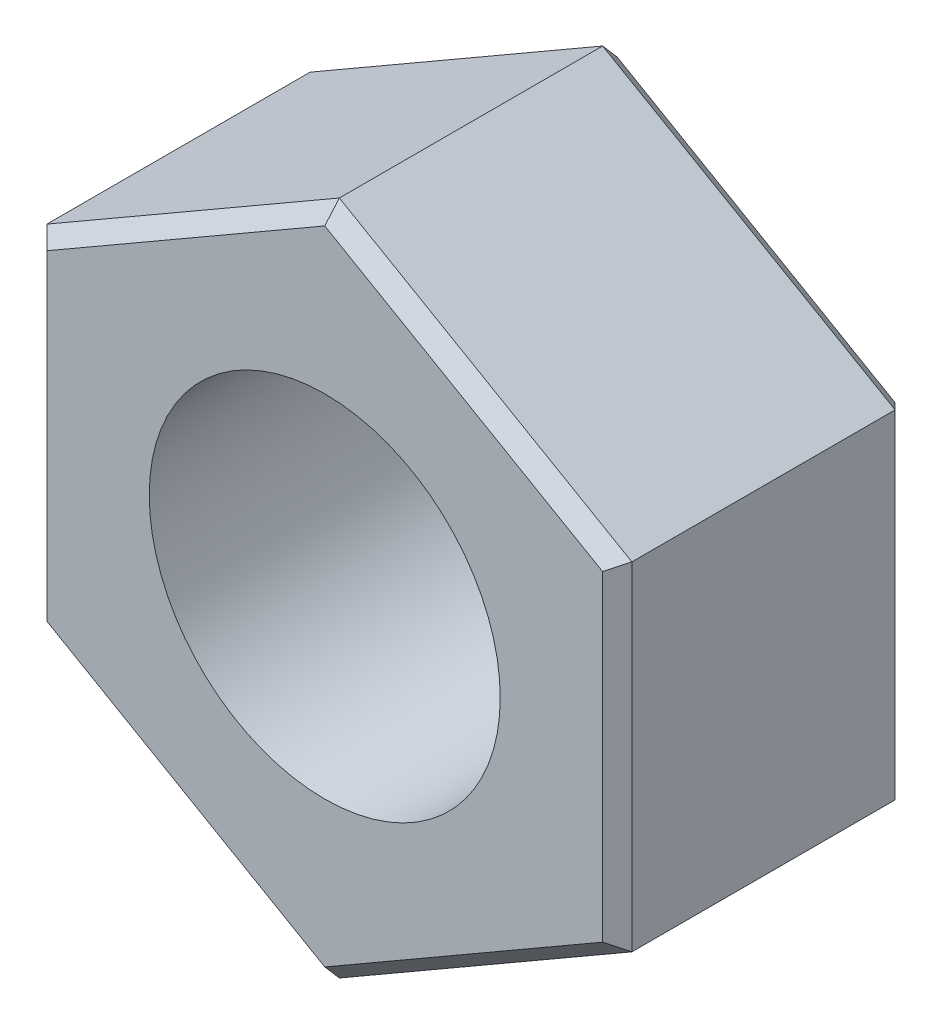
ISO-10303-21;
HEADER;
FILE_DESCRIPTION(('STEP AP214'),'2;1');
FILE_NAME('part.step','',(''),(''),'','','');
FILE_SCHEMA(('AUTOMOTIVE_DESIGN { 1 0 10303 214 1 1 1 1 }'));
ENDSEC;
DATA;
#1=APPLICATION_CONTEXT('core data for automotive mechanical design processes');
#2=APPLICATION_PROTOCOL_DEFINITION('international standard','automotive_design',2000,#1);
#3=PRODUCT_CONTEXT('',#1,'mechanical');
#4=PRODUCT('Part','Part','',(#3));
#5=PRODUCT_RELATED_PRODUCT_CATEGORY('part','',(#4));
#6=PRODUCT_DEFINITION_FORMATION('','',#4);
#7=PRODUCT_DEFINITION_CONTEXT('part definition',#1,'design');
#8=PRODUCT_DEFINITION('design','',#6,#7);
#9=PRODUCT_DEFINITION_SHAPE('','',#8);
#10=(LENGTH_UNIT() NAMED_UNIT(*) SI_UNIT(.MILLI.,.METRE.));
#11=(NAMED_UNIT(*) PLANE_ANGLE_UNIT() SI_UNIT($,.RADIAN.));
#12=(NAMED_UNIT(*) SI_UNIT($,.STERADIAN.) SOLID_ANGLE_UNIT());
#13=UNCERTAINTY_MEASURE_WITH_UNIT(LENGTH_MEASURE(1.E-05),#10,'distance_accuracy_value','');
#14=(GEOMETRIC_REPRESENTATION_CONTEXT(3) GLOBAL_UNCERTAINTY_ASSIGNED_CONTEXT((#13)) GLOBAL_UNIT_ASSIGNED_CONTEXT((#10,
#11,#12)) REPRESENTATION_CONTEXT('',''));
#15=CARTESIAN_POINT('',(0.,0.,0.));
#16=DIRECTION('',(0.,0.,1.));
#17=DIRECTION('',(1.,0.,0.));
#18=AXIS2_PLACEMENT_3D('',#15,#16,#17);
#19=CARTESIAN_POINT('',(5.,2.88675134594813,5.));
#20=DIRECTION('',(-0.5,-0.866025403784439,0.));
#21=DIRECTION('',(0.866025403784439,-0.5,0.));
#22=AXIS2_PLACEMENT_3D('',#19,#20,#21);
#23=PLANE('',#22);
#24=DIRECTION('',(0.,0.,-1.));
#25=VECTOR('',#24,1.);
#26=CARTESIAN_POINT('',(5.,2.88675134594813,5.));
#27=LINE('',#26,#25);
#28=CARTESIAN_POINT('',(5.,2.88675134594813,4.75));
#29=VERTEX_POINT('',#28);
#30=CARTESIAN_POINT('',(5.,2.88675134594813,0.250000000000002));
#31=VERTEX_POINT('',#30);
#32=EDGE_CURVE('E258',#29,#31,#27,.T.);
#33=ORIENTED_EDGE('',*,*,#32,.T.);
#34=DIRECTION('',(-0.866025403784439,0.5,0.));
#35=VECTOR('',#34,1.);
#36=CARTESIAN_POINT('',(5.,2.88675134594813,0.250000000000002));
#37=LINE('',#36,#35);
#38=CARTESIAN_POINT('',(0.,5.77350269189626,0.250000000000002));
#39=VERTEX_POINT('',#38);
#40=EDGE_CURVE('E221',#31,#39,#37,.T.);
#41=ORIENTED_EDGE('',*,*,#40,.T.);
#42=DIRECTION('',(0.,0.,-1.));
#43=VECTOR('',#42,1.);
#44=CARTESIAN_POINT('',(0.,5.77350269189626,5.));
#45=LINE('',#44,#43);
#46=CARTESIAN_POINT('',(0.,5.77350269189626,4.75));
#47=VERTEX_POINT('',#46);
#48=EDGE_CURVE('E157',#47,#39,#45,.T.);
#49=ORIENTED_EDGE('',*,*,#48,.F.);
#50=DIRECTION('',(0.866025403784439,-0.5,0.));
#51=VECTOR('',#50,1.);
#52=CARTESIAN_POINT('',(5.,2.88675134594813,4.75));
#53=LINE('',#52,#51);
#54=EDGE_CURVE('E218',#47,#29,#53,.T.);
#55=ORIENTED_EDGE('',*,*,#54,.T.);
#56=EDGE_LOOP('',(#33,#41,#49,#55));
#57=FACE_BOUND('',#56,.T.);
#58=ADVANCED_FACE('F41',(#57),#23,.F.);
#59=CARTESIAN_POINT('',(0.,5.77350269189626,5.));
#60=DIRECTION('',(0.5,-0.866025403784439,0.));
#61=DIRECTION('',(0.866025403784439,0.5,0.));
#62=AXIS2_PLACEMENT_3D('',#59,#60,#61);
#63=PLANE('',#62);
#64=ORIENTED_EDGE('',*,*,#48,.T.);
#65=DIRECTION('',(-0.866025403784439,-0.5,0.));
#66=VECTOR('',#65,1.);
#67=CARTESIAN_POINT('',(0.,5.77350269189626,0.250000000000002));
#68=LINE('',#67,#66);
#69=CARTESIAN_POINT('',(-5.,2.88675134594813,0.250000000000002));
#70=VERTEX_POINT('',#69);
#71=EDGE_CURVE('E155',#39,#70,#68,.T.);
#72=ORIENTED_EDGE('',*,*,#71,.T.);
#73=DIRECTION('',(0.,0.,-1.));
#74=VECTOR('',#73,1.);
#75=CARTESIAN_POINT('',(-5.,2.88675134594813,5.));
#76=LINE('',#75,#74);
#77=CARTESIAN_POINT('',(-5.,2.88675134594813,4.75));
#78=VERTEX_POINT('',#77);
#79=EDGE_CURVE('E136',#78,#70,#76,.T.);
#80=ORIENTED_EDGE('',*,*,#79,.F.);
#81=DIRECTION('',(0.866025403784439,0.5,0.));
#82=VECTOR('',#81,1.);
#83=CARTESIAN_POINT('',(0.,5.77350269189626,4.75));
#84=LINE('',#83,#82);
#85=EDGE_CURVE('E152',#78,#47,#84,.T.);
#86=ORIENTED_EDGE('',*,*,#85,.T.);
#87=EDGE_LOOP('',(#64,#72,#80,#86));
#88=FACE_BOUND('',#87,.T.);
#89=ADVANCED_FACE('F150',(#88),#63,.F.);
#90=CARTESIAN_POINT('',(-5.,2.88675134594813,5.));
#91=DIRECTION('',(1.,0.,0.));
#92=DIRECTION('',(0.,1.,0.));
#93=AXIS2_PLACEMENT_3D('',#90,#91,#92);
#94=PLANE('',#93);
#95=ORIENTED_EDGE('',*,*,#79,.T.);
#96=DIRECTION('',(0.,-1.,0.));
#97=VECTOR('',#96,1.);
#98=CARTESIAN_POINT('',(-5.,2.88675134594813,0.250000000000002));
#99=LINE('',#98,#97);
#100=CARTESIAN_POINT('',(-5.,-2.88675134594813,0.250000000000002));
#101=VERTEX_POINT('',#100);
#102=EDGE_CURVE('E144',#70,#101,#99,.T.);
#103=ORIENTED_EDGE('',*,*,#102,.T.);
#104=DIRECTION('',(0.,0.,-1.));
#105=VECTOR('',#104,1.);
#106=CARTESIAN_POINT('',(-5.,-2.88675134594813,5.));
#107=LINE('',#106,#105);
#108=CARTESIAN_POINT('',(-5.,-2.88675134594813,4.75));
#109=VERTEX_POINT('',#108);
#110=EDGE_CURVE('E138',#109,#101,#107,.T.);
#111=ORIENTED_EDGE('',*,*,#110,.F.);
#112=DIRECTION('',(0.,1.,0.));
#113=VECTOR('',#112,1.);
#114=CARTESIAN_POINT('',(-5.,2.88675134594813,4.75));
#115=LINE('',#114,#113);
#116=EDGE_CURVE('E133',#109,#78,#115,.T.);
#117=ORIENTED_EDGE('',*,*,#116,.T.);
#118=EDGE_LOOP('',(#95,#103,#111,#117));
#119=FACE_BOUND('',#118,.T.);
#120=ADVANCED_FACE('F135',(#119),#94,.F.);
#121=CARTESIAN_POINT('',(-5.,-2.88675134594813,5.));
#122=DIRECTION('',(0.5,0.866025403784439,0.));
#123=DIRECTION('',(-0.866025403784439,0.5,0.));
#124=AXIS2_PLACEMENT_3D('',#121,#122,#123);
#125=PLANE('',#124);
#126=ORIENTED_EDGE('',*,*,#110,.T.);
#127=DIRECTION('',(0.866025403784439,-0.5,0.));
#128=VECTOR('',#127,1.);
#129=CARTESIAN_POINT('',(-5.,-2.88675134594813,0.250000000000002));
#130=LINE('',#129,#128);
#131=CARTESIAN_POINT('',(0.,-5.77350269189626,0.250000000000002));
#132=VERTEX_POINT('',#131);
#133=EDGE_CURVE('E202',#101,#132,#130,.T.);
#134=ORIENTED_EDGE('',*,*,#133,.T.);
#135=DIRECTION('',(0.,0.,-1.));
#136=VECTOR('',#135,1.);
#137=CARTESIAN_POINT('',(0.,-5.77350269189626,5.));
#138=LINE('',#137,#136);
#139=CARTESIAN_POINT('',(0.,-5.77350269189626,4.75));
#140=VERTEX_POINT('',#139);
#141=EDGE_CURVE('E281',#140,#132,#138,.T.);
#142=ORIENTED_EDGE('',*,*,#141,.F.);
#143=DIRECTION('',(-0.866025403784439,0.5,0.));
#144=VECTOR('',#143,1.);
#145=CARTESIAN_POINT('',(-5.,-2.88675134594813,4.75));
#146=LINE('',#145,#144);
#147=EDGE_CURVE('E199',#140,#109,#146,.T.);
#148=ORIENTED_EDGE('',*,*,#147,.T.);
#149=EDGE_LOOP('',(#126,#134,#142,#148));
#150=FACE_BOUND('',#149,.T.);
#151=ADVANCED_FACE('F278',(#150),#125,.F.);
#152=CARTESIAN_POINT('',(0.,-5.77350269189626,5.));
#153=DIRECTION('',(-0.5,0.866025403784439,0.));
#154=DIRECTION('',(-0.866025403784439,-0.5,0.));
#155=AXIS2_PLACEMENT_3D('',#152,#153,#154);
#156=PLANE('',#155);
#157=ORIENTED_EDGE('',*,*,#141,.T.);
#158=DIRECTION('',(0.866025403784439,0.5,0.));
#159=VECTOR('',#158,1.);
#160=CARTESIAN_POINT('',(0.,-5.77350269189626,0.250000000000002));
#161=LINE('',#160,#159);
#162=CARTESIAN_POINT('',(5.,-2.88675134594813,0.250000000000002));
#163=VERTEX_POINT('',#162);
#164=EDGE_CURVE('E208',#132,#163,#161,.T.);
#165=ORIENTED_EDGE('',*,*,#164,.T.);
#166=DIRECTION('',(0.,0.,-1.));
#167=VECTOR('',#166,1.);
#168=CARTESIAN_POINT('',(5.,-2.88675134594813,5.));
#169=LINE('',#168,#167);
#170=CARTESIAN_POINT('',(5.,-2.88675134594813,4.75));
#171=VERTEX_POINT('',#170);
#172=EDGE_CURVE('E285',#171,#163,#169,.T.);
#173=ORIENTED_EDGE('',*,*,#172,.F.);
#174=DIRECTION('',(-0.866025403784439,-0.5,0.));
#175=VECTOR('',#174,1.);
#176=CARTESIAN_POINT('',(0.,-5.77350269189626,4.75));
#177=LINE('',#176,#175);
#178=EDGE_CURVE('E205',#171,#140,#177,.T.);
#179=ORIENTED_EDGE('',*,*,#178,.T.);
#180=EDGE_LOOP('',(#157,#165,#173,#179));
#181=FACE_BOUND('',#180,.T.);
#182=ADVANCED_FACE('F324',(#181),#156,.F.);
#183=CARTESIAN_POINT('',(5.,-2.88675134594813,5.));
#184=DIRECTION('',(-1.,0.,0.));
#185=DIRECTION('',(0.,-1.,0.));
#186=AXIS2_PLACEMENT_3D('',#183,#184,#185);
#187=PLANE('',#186);
#188=ORIENTED_EDGE('',*,*,#172,.T.);
#189=DIRECTION('',(0.,1.,0.));
#190=VECTOR('',#189,1.);
#191=CARTESIAN_POINT('',(5.,-2.88675134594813,0.250000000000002));
#192=LINE('',#191,#190);
#193=EDGE_CURVE('E215',#163,#31,#192,.T.);
#194=ORIENTED_EDGE('',*,*,#193,.T.);
#195=ORIENTED_EDGE('',*,*,#32,.F.);
#196=DIRECTION('',(0.,-1.,0.));
#197=VECTOR('',#196,1.);
#198=CARTESIAN_POINT('',(5.,-2.88675134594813,4.75));
#199=LINE('',#198,#197);
#200=EDGE_CURVE('E211',#29,#171,#199,.T.);
#201=ORIENTED_EDGE('',*,*,#200,.T.);
#202=EDGE_LOOP('',(#188,#194,#195,#201));
#203=FACE_BOUND('',#202,.T.);
#204=ADVANCED_FACE('F316',(#203),#187,.F.);
#205=CARTESIAN_POINT('',(0.,0.,5.));
#206=DIRECTION('',(0.,0.,1.));
#207=DIRECTION('',(1.,0.,0.));
#208=AXIS2_PLACEMENT_3D('',#205,#206,#207);
#209=PLANE('',#208);
#210=CARTESIAN_POINT('',(0.,0.,5.));
#211=DIRECTION('',(0.,0.,1.));
#212=DIRECTION('',(1.,0.,0.));
#213=AXIS2_PLACEMENT_3D('',#210,#211,#212);
#214=CIRCLE('',#213,3.);
#215=CARTESIAN_POINT('',(3.,0.,5.));
#216=VERTEX_POINT('',#215);
#217=EDGE_CURVE('E296',#216,#216,#214,.T.);
#218=ORIENTED_EDGE('',*,*,#217,.F.);
#219=EDGE_LOOP('',(#218));
#220=FACE_BOUND('',#219,.T.);
#221=DIRECTION('',(0.866025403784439,0.5,0.));
#222=VECTOR('',#221,1.);
#223=CARTESIAN_POINT('',(4.875,-2.67024499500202,5.));
#224=LINE('',#223,#222);
#225=CARTESIAN_POINT('',(0.,-5.48482755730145,5.));
#226=VERTEX_POINT('',#225);
#227=CARTESIAN_POINT('',(4.75,-2.74241377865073,5.));
#228=VERTEX_POINT('',#227);
#229=EDGE_CURVE('E52',#226,#228,#224,.T.);
#230=ORIENTED_EDGE('',*,*,#229,.T.);
#231=DIRECTION('',(0.,1.,0.));
#232=VECTOR('',#231,1.);
#233=CARTESIAN_POINT('',(4.75,2.88675134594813,5.));
#234=LINE('',#233,#232);
#235=CARTESIAN_POINT('',(4.75,2.74241377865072,5.));
#236=VERTEX_POINT('',#235);
#237=EDGE_CURVE('E11',#228,#236,#234,.T.);
#238=ORIENTED_EDGE('',*,*,#237,.T.);
#239=DIRECTION('',(-0.866025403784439,0.5,0.));
#240=VECTOR('',#239,1.);
#241=CARTESIAN_POINT('',(-0.124999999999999,5.55699634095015,5.));
#242=LINE('',#241,#240);
#243=CARTESIAN_POINT('',(0.,5.48482755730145,5.));
#244=VERTEX_POINT('',#243);
#245=EDGE_CURVE('E224',#236,#244,#242,.T.);
#246=ORIENTED_EDGE('',*,*,#245,.T.);
#247=DIRECTION('',(-0.866025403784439,-0.5,0.));
#248=VECTOR('',#247,1.);
#249=CARTESIAN_POINT('',(-4.875,2.67024499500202,5.));
#250=LINE('',#249,#248);
#251=CARTESIAN_POINT('',(-4.75,2.74241377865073,5.));
#252=VERTEX_POINT('',#251);
#253=EDGE_CURVE('E227',#244,#252,#250,.T.);
#254=ORIENTED_EDGE('',*,*,#253,.T.);
#255=DIRECTION('',(0.,-1.,0.));
#256=VECTOR('',#255,1.);
#257=CARTESIAN_POINT('',(-4.75,-2.88675134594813,5.));
#258=LINE('',#257,#256);
#259=CARTESIAN_POINT('',(-4.75,-2.74241377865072,5.));
#260=VERTEX_POINT('',#259);
#261=EDGE_CURVE('E162',#252,#260,#258,.T.);
#262=ORIENTED_EDGE('',*,*,#261,.T.);
#263=DIRECTION('',(0.866025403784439,-0.5,0.));
#264=VECTOR('',#263,1.);
#265=CARTESIAN_POINT('',(0.125000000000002,-5.55699634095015,5.));
#266=LINE('',#265,#264);
#267=EDGE_CURVE('E63',#260,#226,#266,.T.);
#268=ORIENTED_EDGE('',*,*,#267,.T.);
#269=EDGE_LOOP('',(#230,#238,#246,#254,#262,#268));
#270=FACE_BOUND('',#269,.T.);
#271=ADVANCED_FACE('F314',(#220,#270),#209,.T.);
#272=CARTESIAN_POINT('',(0.,0.,0.));
#273=DIRECTION('',(0.,0.,1.));
#274=DIRECTION('',(1.,0.,0.));
#275=AXIS2_PLACEMENT_3D('',#272,#273,#274);
#276=PLANE('',#275);
#277=CARTESIAN_POINT('',(0.,0.,0.));
#278=DIRECTION('',(0.,0.,1.));
#279=DIRECTION('',(1.,0.,0.));
#280=AXIS2_PLACEMENT_3D('',#277,#278,#279);
#281=CIRCLE('',#280,3.);
#282=CARTESIAN_POINT('',(3.,0.,0.));
#283=VERTEX_POINT('',#282);
#284=EDGE_CURVE('E263',#283,#283,#281,.T.);
#285=ORIENTED_EDGE('',*,*,#284,.T.);
#286=EDGE_LOOP('',(#285));
#287=FACE_BOUND('',#286,.T.);
#288=DIRECTION('',(0.,1.,0.));
#289=VECTOR('',#288,1.);
#290=CARTESIAN_POINT('',(-4.74999999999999,0.,0.));
#291=LINE('',#290,#289);
#292=CARTESIAN_POINT('',(-4.74999999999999,-2.74241377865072,0.));
#293=VERTEX_POINT('',#292);
#294=CARTESIAN_POINT('',(-4.74999999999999,2.74241377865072,0.));
#295=VERTEX_POINT('',#294);
#296=EDGE_CURVE('E191',#293,#295,#291,.T.);
#297=ORIENTED_EDGE('',*,*,#296,.T.);
#298=DIRECTION('',(0.866025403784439,0.5,0.));
#299=VECTOR('',#298,1.);
#300=CARTESIAN_POINT('',(-2.375,4.11362066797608,0.));
#301=LINE('',#300,#299);
#302=CARTESIAN_POINT('',(0.,5.48482755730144,0.));
#303=VERTEX_POINT('',#302);
#304=EDGE_CURVE('E145',#295,#303,#301,.T.);
#305=ORIENTED_EDGE('',*,*,#304,.T.);
#306=DIRECTION('',(0.866025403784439,-0.5,0.));
#307=VECTOR('',#306,1.);
#308=CARTESIAN_POINT('',(2.375,4.11362066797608,0.));
#309=LINE('',#308,#307);
#310=CARTESIAN_POINT('',(4.75,2.74241377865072,0.));
#311=VERTEX_POINT('',#310);
#312=EDGE_CURVE('E176',#303,#311,#309,.T.);
#313=ORIENTED_EDGE('',*,*,#312,.T.);
#314=DIRECTION('',(0.,-1.,0.));
#315=VECTOR('',#314,1.);
#316=CARTESIAN_POINT('',(4.75,0.,0.));
#317=LINE('',#316,#315);
#318=CARTESIAN_POINT('',(4.75,-2.74241377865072,0.));
#319=VERTEX_POINT('',#318);
#320=EDGE_CURVE('E182',#311,#319,#317,.T.);
#321=ORIENTED_EDGE('',*,*,#320,.T.);
#322=DIRECTION('',(-0.866025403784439,-0.5,0.));
#323=VECTOR('',#322,1.);
#324=CARTESIAN_POINT('',(2.375,-4.11362066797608,0.));
#325=LINE('',#324,#323);
#326=CARTESIAN_POINT('',(0.,-5.48482755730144,0.));
#327=VERTEX_POINT('',#326);
#328=EDGE_CURVE('E185',#319,#327,#325,.T.);
#329=ORIENTED_EDGE('',*,*,#328,.T.);
#330=DIRECTION('',(-0.866025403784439,0.5,0.));
#331=VECTOR('',#330,1.);
#332=CARTESIAN_POINT('',(-2.375,-4.11362066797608,0.));
#333=LINE('',#332,#331);
#334=EDGE_CURVE('E188',#327,#293,#333,.T.);
#335=ORIENTED_EDGE('',*,*,#334,.T.);
#336=EDGE_LOOP('',(#297,#305,#313,#321,#329,#335));
#337=FACE_BOUND('',#336,.T.);
#338=ADVANCED_FACE('F304',(#287,#337),#276,.F.);
#339=CARTESIAN_POINT('',(0.,-5.77350269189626,0.250000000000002));
#340=DIRECTION('',(-0.353553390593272,0.612372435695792,0.707106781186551));
#341=DIRECTION('',(0.866025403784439,0.5,0.));
#342=AXIS2_PLACEMENT_3D('',#339,#340,#341);
#343=PLANE('',#342);
#344=DIRECTION('',(0.,0.755928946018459,-0.654653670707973));
#345=VECTOR('',#344,1.);
#346=CARTESIAN_POINT('',(0.,-5.77350269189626,0.250000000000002));
#347=LINE('',#346,#345);
#348=EDGE_CURVE('E250',#327,#132,#347,.F.);
#349=ORIENTED_EDGE('',*,*,#348,.F.);
#350=ORIENTED_EDGE('',*,*,#328,.F.);
#351=DIRECTION('',(-0.654653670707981,0.377964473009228,-0.654653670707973));
#352=VECTOR('',#351,1.);
#353=CARTESIAN_POINT('',(5.,-2.88675134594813,0.250000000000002));
#354=LINE('',#353,#352);
#355=EDGE_CURVE('E254',#163,#319,#354,.T.);
#356=ORIENTED_EDGE('',*,*,#355,.F.);
#357=ORIENTED_EDGE('',*,*,#164,.F.);
#358=EDGE_LOOP('',(#349,#350,#356,#357));
#359=FACE_BOUND('',#358,.T.);
#360=ADVANCED_FACE('F322',(#359),#343,.F.);
#361=CARTESIAN_POINT('',(5.,-2.88675134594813,0.250000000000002));
#362=DIRECTION('',(-0.707106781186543,0.,0.707106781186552));
#363=DIRECTION('',(0.,1.,0.));
#364=AXIS2_PLACEMENT_3D('',#361,#362,#363);
#365=PLANE('',#364);
#366=ORIENTED_EDGE('',*,*,#355,.T.);
#367=ORIENTED_EDGE('',*,*,#320,.F.);
#368=DIRECTION('',(-0.65465367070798,-0.37796447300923,-0.654653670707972));
#369=VECTOR('',#368,1.);
#370=CARTESIAN_POINT('',(5.,2.88675134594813,0.250000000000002));
#371=LINE('',#370,#369);
#372=EDGE_CURVE('E246',#31,#311,#371,.T.);
#373=ORIENTED_EDGE('',*,*,#372,.F.);
#374=ORIENTED_EDGE('',*,*,#193,.F.);
#375=EDGE_LOOP('',(#366,#367,#373,#374));
#376=FACE_BOUND('',#375,.T.);
#377=ADVANCED_FACE('F364',(#376),#365,.F.);
#378=CARTESIAN_POINT('',(-5.,-2.88675134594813,0.250000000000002));
#379=DIRECTION('',(0.353553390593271,0.61237243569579,0.707106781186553));
#380=DIRECTION('',(0.866025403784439,-0.5,0.));
#381=AXIS2_PLACEMENT_3D('',#378,#379,#380);
#382=PLANE('',#381);
#383=ORIENTED_EDGE('',*,*,#348,.T.);
#384=ORIENTED_EDGE('',*,*,#133,.F.);
#385=DIRECTION('',(0.654653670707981,0.377964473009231,-0.654653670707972));
#386=VECTOR('',#385,1.);
#387=CARTESIAN_POINT('',(-5.,-2.88675134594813,0.250000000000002));
#388=LINE('',#387,#386);
#389=EDGE_CURVE('E242',#293,#101,#388,.F.);
#390=ORIENTED_EDGE('',*,*,#389,.F.);
#391=ORIENTED_EDGE('',*,*,#334,.F.);
#392=EDGE_LOOP('',(#383,#384,#390,#391));
#393=FACE_BOUND('',#392,.T.);
#394=ADVANCED_FACE('F357',(#393),#382,.F.);
#395=CARTESIAN_POINT('',(5.,2.88675134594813,0.250000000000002));
#396=DIRECTION('',(-0.353553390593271,-0.61237243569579,0.707106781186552));
#397=DIRECTION('',(-0.866025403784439,0.5,0.));
#398=AXIS2_PLACEMENT_3D('',#395,#396,#397);
#399=PLANE('',#398);
#400=ORIENTED_EDGE('',*,*,#372,.T.);
#401=ORIENTED_EDGE('',*,*,#312,.F.);
#402=DIRECTION('',(0.,0.755928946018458,0.654653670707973));
#403=VECTOR('',#402,1.);
#404=CARTESIAN_POINT('',(0.,4.1239304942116,-1.17857142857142));
#405=LINE('',#404,#403);
#406=EDGE_CURVE('E239',#39,#303,#405,.F.);
#407=ORIENTED_EDGE('',*,*,#406,.F.);
#408=ORIENTED_EDGE('',*,*,#40,.F.);
#409=EDGE_LOOP('',(#400,#401,#407,#408));
#410=FACE_BOUND('',#409,.T.);
#411=ADVANCED_FACE('F350',(#410),#399,.F.);
#412=CARTESIAN_POINT('',(-5.,2.88675134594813,0.250000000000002));
#413=DIRECTION('',(0.707106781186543,0.,0.707106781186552));
#414=DIRECTION('',(0.,-1.,0.));
#415=AXIS2_PLACEMENT_3D('',#412,#413,#414);
#416=PLANE('',#415);
#417=ORIENTED_EDGE('',*,*,#389,.T.);
#418=ORIENTED_EDGE('',*,*,#102,.F.);
#419=DIRECTION('',(0.654653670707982,-0.377964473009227,-0.654653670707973));
#420=VECTOR('',#419,1.);
#421=CARTESIAN_POINT('',(-5.,2.88675134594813,0.250000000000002));
#422=LINE('',#421,#420);
#423=EDGE_CURVE('E236',#295,#70,#422,.F.);
#424=ORIENTED_EDGE('',*,*,#423,.F.);
#425=ORIENTED_EDGE('',*,*,#296,.F.);
#426=EDGE_LOOP('',(#417,#418,#424,#425));
#427=FACE_BOUND('',#426,.T.);
#428=ADVANCED_FACE('F343',(#427),#416,.F.);
#429=CARTESIAN_POINT('',(0.,5.77350269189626,0.250000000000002));
#430=DIRECTION('',(0.353553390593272,-0.612372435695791,0.707106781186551));
#431=DIRECTION('',(-0.866025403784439,-0.5,0.));
#432=AXIS2_PLACEMENT_3D('',#429,#430,#431);
#433=PLANE('',#432);
#434=ORIENTED_EDGE('',*,*,#406,.T.);
#435=ORIENTED_EDGE('',*,*,#304,.F.);
#436=ORIENTED_EDGE('',*,*,#423,.T.);
#437=ORIENTED_EDGE('',*,*,#71,.F.);
#438=EDGE_LOOP('',(#434,#435,#436,#437));
#439=FACE_BOUND('',#438,.T.);
#440=ADVANCED_FACE('F337',(#439),#433,.F.);
#441=CARTESIAN_POINT('',(-4.75,0.,5.));
#442=DIRECTION('',(-0.707106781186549,0.,0.707106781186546));
#443=DIRECTION('',(0.,1.,0.));
#444=AXIS2_PLACEMENT_3D('',#441,#442,#443);
#445=PLANE('',#444);
#446=DIRECTION('',(0.654653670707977,-0.377964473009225,0.654653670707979));
#447=VECTOR('',#446,1.);
#448=CARTESIAN_POINT('',(-4.07142857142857,2.35064038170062,5.67857142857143));
#449=LINE('',#448,#447);
#450=EDGE_CURVE('E161',#78,#252,#449,.T.);
#451=ORIENTED_EDGE('',*,*,#450,.F.);
#452=ORIENTED_EDGE('',*,*,#116,.F.);
#453=DIRECTION('',(0.654653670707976,0.377964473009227,0.654653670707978));
#454=VECTOR('',#453,1.);
#455=CARTESIAN_POINT('',(-4.07142857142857,-2.35064038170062,5.67857142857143));
#456=LINE('',#455,#454);
#457=EDGE_CURVE('E46',#260,#109,#456,.F.);
#458=ORIENTED_EDGE('',*,*,#457,.F.);
#459=ORIENTED_EDGE('',*,*,#261,.F.);
#460=EDGE_LOOP('',(#451,#452,#458,#459));
#461=FACE_BOUND('',#460,.T.);
#462=ADVANCED_FACE('F44',(#461),#445,.T.);
#463=CARTESIAN_POINT('',(-2.375,-4.11362066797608,5.));
#464=DIRECTION('',(-0.353553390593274,-0.612372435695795,0.707106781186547));
#465=DIRECTION('',(-0.866025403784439,0.5,0.));
#466=AXIS2_PLACEMENT_3D('',#463,#464,#465);
#467=PLANE('',#466);
#468=ORIENTED_EDGE('',*,*,#457,.T.);
#469=ORIENTED_EDGE('',*,*,#147,.F.);
#470=DIRECTION('',(0.,0.755928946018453,0.654653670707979));
#471=VECTOR('',#470,1.);
#472=CARTESIAN_POINT('',(0.,-4.70128076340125,5.67857142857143));
#473=LINE('',#472,#471);
#474=EDGE_CURVE('E166',#226,#140,#473,.F.);
#475=ORIENTED_EDGE('',*,*,#474,.F.);
#476=ORIENTED_EDGE('',*,*,#267,.F.);
#477=EDGE_LOOP('',(#468,#469,#475,#476));
#478=FACE_BOUND('',#477,.T.);
#479=ADVANCED_FACE('F275',(#478),#467,.T.);
#480=CARTESIAN_POINT('',(-2.375,4.11362066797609,5.));
#481=DIRECTION('',(-0.353553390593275,0.612372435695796,0.707106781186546));
#482=DIRECTION('',(0.866025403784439,0.5,0.));
#483=AXIS2_PLACEMENT_3D('',#480,#481,#482);
#484=PLANE('',#483);
#485=ORIENTED_EDGE('',*,*,#450,.T.);
#486=ORIENTED_EDGE('',*,*,#253,.F.);
#487=DIRECTION('',(0.,-0.755928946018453,0.654653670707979));
#488=VECTOR('',#487,1.);
#489=CARTESIAN_POINT('',(0.,4.70128076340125,5.67857142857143));
#490=LINE('',#489,#488);
#491=EDGE_CURVE('E170',#47,#244,#490,.T.);
#492=ORIENTED_EDGE('',*,*,#491,.F.);
#493=ORIENTED_EDGE('',*,*,#85,.F.);
#494=EDGE_LOOP('',(#485,#486,#492,#493));
#495=FACE_BOUND('',#494,.T.);
#496=ADVANCED_FACE('F168',(#495),#484,.T.);
#497=CARTESIAN_POINT('',(2.375,-4.11362066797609,5.));
#498=DIRECTION('',(0.353553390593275,-0.612372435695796,0.707106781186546));
#499=DIRECTION('',(-0.866025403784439,-0.5,0.));
#500=AXIS2_PLACEMENT_3D('',#497,#498,#499);
#501=PLANE('',#500);
#502=ORIENTED_EDGE('',*,*,#474,.T.);
#503=ORIENTED_EDGE('',*,*,#178,.F.);
#504=DIRECTION('',(-0.654653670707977,0.377964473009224,0.654653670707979));
#505=VECTOR('',#504,1.);
#506=CARTESIAN_POINT('',(4.07142857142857,-2.35064038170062,5.67857142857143));
#507=LINE('',#506,#505);
#508=EDGE_CURVE('E262',#228,#171,#507,.F.);
#509=ORIENTED_EDGE('',*,*,#508,.F.);
#510=ORIENTED_EDGE('',*,*,#229,.F.);
#511=EDGE_LOOP('',(#502,#503,#509,#510));
#512=FACE_BOUND('',#511,.T.);
#513=ADVANCED_FACE('F272',(#512),#501,.T.);
#514=CARTESIAN_POINT('',(2.375,4.11362066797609,5.));
#515=DIRECTION('',(0.353553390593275,0.612372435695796,0.707106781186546));
#516=DIRECTION('',(0.866025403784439,-0.5,0.));
#517=AXIS2_PLACEMENT_3D('',#514,#515,#516);
#518=PLANE('',#517);
#519=ORIENTED_EDGE('',*,*,#491,.T.);
#520=ORIENTED_EDGE('',*,*,#245,.F.);
#521=DIRECTION('',(0.654653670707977,0.377964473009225,-0.654653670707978));
#522=VECTOR('',#521,1.);
#523=CARTESIAN_POINT('',(4.07142857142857,2.35064038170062,5.67857142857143));
#524=LINE('',#523,#522);
#525=EDGE_CURVE('E259',#29,#236,#524,.F.);
#526=ORIENTED_EDGE('',*,*,#525,.F.);
#527=ORIENTED_EDGE('',*,*,#54,.F.);
#528=EDGE_LOOP('',(#519,#520,#526,#527));
#529=FACE_BOUND('',#528,.T.);
#530=ADVANCED_FACE('F383',(#529),#518,.T.);
#531=CARTESIAN_POINT('',(4.75,0.,5.));
#532=DIRECTION('',(0.707106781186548,0.,0.707106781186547));
#533=DIRECTION('',(0.,-1.,0.));
#534=AXIS2_PLACEMENT_3D('',#531,#532,#533);
#535=PLANE('',#534);
#536=ORIENTED_EDGE('',*,*,#508,.T.);
#537=ORIENTED_EDGE('',*,*,#200,.F.);
#538=ORIENTED_EDGE('',*,*,#525,.T.);
#539=ORIENTED_EDGE('',*,*,#237,.F.);
#540=EDGE_LOOP('',(#536,#537,#538,#539));
#541=FACE_BOUND('',#540,.T.);
#542=ADVANCED_FACE('F310',(#541),#535,.T.);
#543=CARTESIAN_POINT('',(0.,0.,0.));
#544=DIRECTION('',(0.,0.,1.));
#545=DIRECTION('',(1.,0.,0.));
#546=AXIS2_PLACEMENT_3D('',#543,#544,#545);
#547=CYLINDRICAL_SURFACE('',#546,3.);
#548=ORIENTED_EDGE('',*,*,#284,.F.);
#549=EDGE_LOOP('',(#548));
#550=FACE_BOUND('',#549,.T.);
#551=ORIENTED_EDGE('',*,*,#217,.T.);
#552=EDGE_LOOP('',(#551));
#553=FACE_BOUND('',#552,.T.);
#554=ADVANCED_FACE('F307',(#550,#553),#547,.F.);
#555=CLOSED_SHELL('',(#58,#89,#120,#151,#182,#204,#271,#338,#360,#377,#394,#411,#428,#440,#462,
#479,#496,#513,#530,#542,#554));
#556=MANIFOLD_SOLID_BREP('B2',#555);
#557=ADVANCED_BREP_SHAPE_REPRESENTATION('',(#18,#556),#14);
#558=SHAPE_DEFINITION_REPRESENTATION(#9,#557);
ENDSEC;
END-ISO-10303-21;
